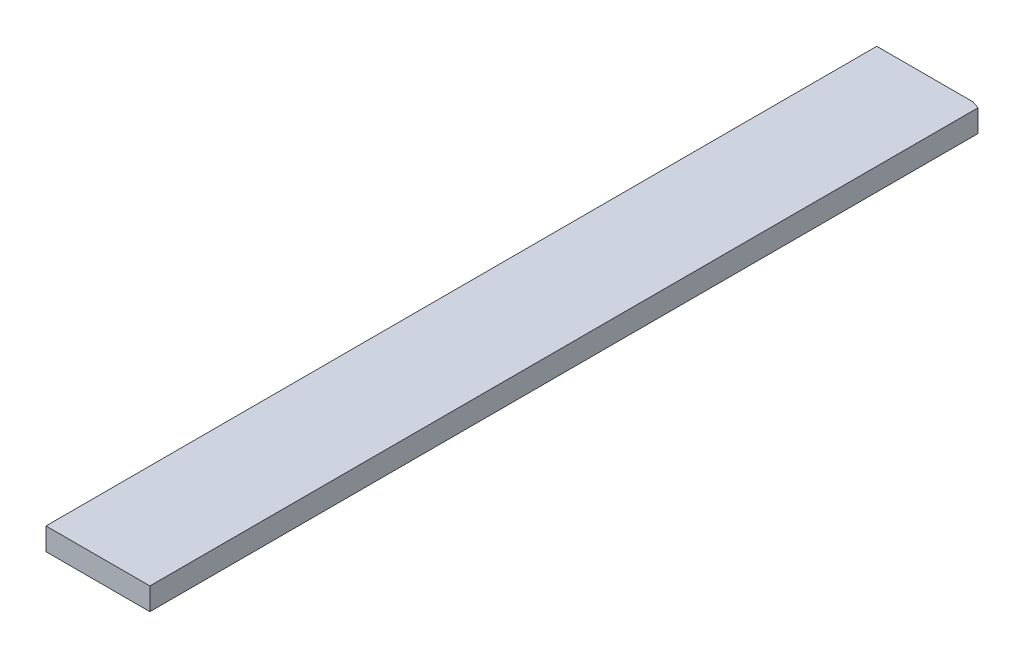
from build123d import *

# Parameters (mm, degrees)
SKETCH1_W           = 590.55
SKETCH1_H           = 5175.34144
BOSS_EXTRUDE1_DEPTH = 127
SKETCH2_W           = 590.55
SKETCH2_H           = 452.738252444
CUT_EXTRUDE1_DEPTH  = 2608.557493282


with BuildPart() as part:
    # Sketch1 → Boss-Extrude1 (new body)
    with BuildSketch(Plane(origin=(0, 0, 0), x_dir=(1, 0, 0), z_dir=(0, 1, 0))):
        Rectangle(SKETCH1_W, SKETCH1_H)
    extrude(amount=BOSS_EXTRUDE1_DEPTH)

    # Sketch2 → Cut-Extrude1 (cut, through all)
    with BuildSketch(Plane.XZ):
        with Locations((0, 2361.301593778)):
            Rectangle(SKETCH2_W, SKETCH2_H)
        Polygon((295.275, -2587.67072), (295.275, -2572.601778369), (251.511615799, -2587.67072), align=None)
    extrude(amount=-CUT_EXTRUDE1_DEPTH, mode=Mode.SUBTRACT)


solid = part.part
